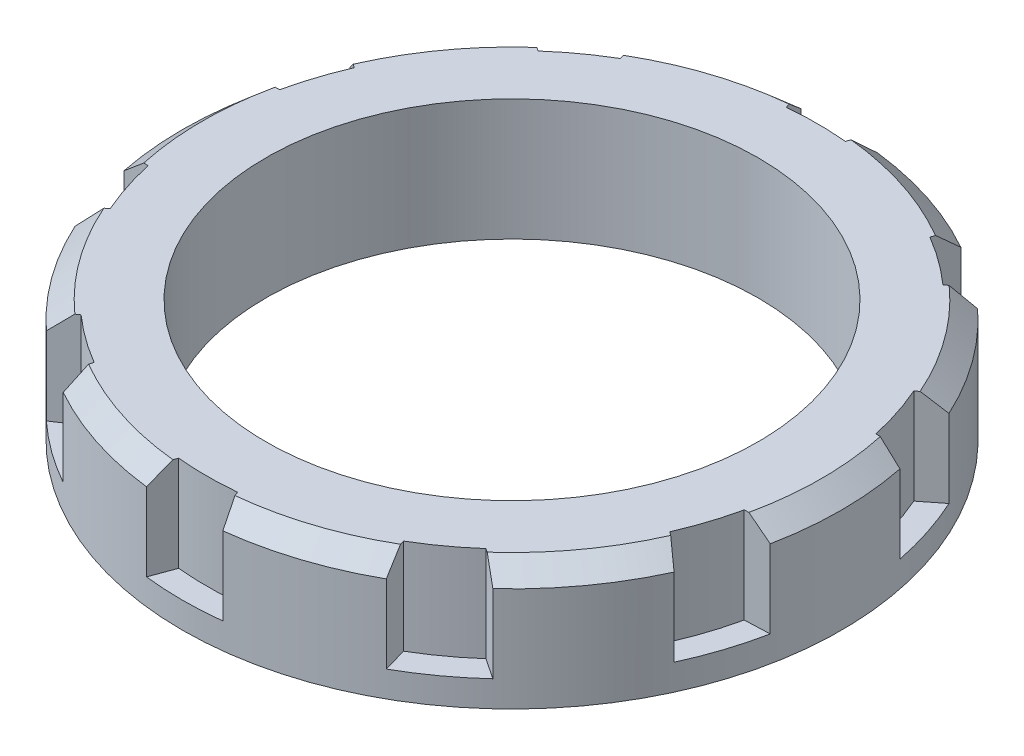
from build123d import *

# Parameters (mm, degrees)
CUT_EXTRUDE_START   = -5.5
SKETCH_2_R          = 25
CUT_EXTRUDE_1_DEPTH = 5.5


with BuildPart() as part:
    # Sketch 1 → Revolve 1 (revolve)
    with BuildSketch(Plane.XY, mode=Mode.PRIVATE) as revolve_1_sk:
        Polygon((-19, 6), (-19, 0), (-14.188, 0), (-14.188, 7), (-17.85, 7), align=None)
    revolve(revolve_1_sk.sketch.rotate(Axis((0, 7, 0), (0, -1, 0)), 90), axis=Axis((0, 7, 0), (0, -1, 0)))

    # Sketch 2 → Cut-Extrude 1 (cut)
    with BuildSketch(Plane(origin=(0, 7, 0), x_dir=(1, 0, 0), z_dir=(0, 1, 0)).offset(CUT_EXTRUDE_START)):
        Circle(SKETCH_2_R)
        with BuildLine():
            Line((-18.628367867, -3.739506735), (-17.185656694, -3.796472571))
            ThreePointArc((-17.185656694, -3.796472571), (-16.738594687, -5.438699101), (-16.134998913, -7.030064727))
            Line((-16.134998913, -7.030064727), (-17.268693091, -7.924155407))
            ThreePointArc((-17.268693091, -7.924155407), (-15.371322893, -11.167919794), (-12.872639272, -13.974804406))
            Line((-12.872639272, -13.974804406), (-11.671977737, -13.172886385))
            ThreePointArc((-11.671977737, -13.172886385), (-10.34502044, -14.238699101), (-8.921319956, -15.171356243))
            Line((-8.921319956, -15.171356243), (-9.312964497, -16.561059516))
            ThreePointArc((-9.312964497, -16.561059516), (-5.871322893, -18.07007381), (-2.2, -18.872201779))
            Line((-2.2, -18.872201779), (-1.7, -17.517705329))
            ThreePointArc((-1.7, -17.517705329), (0, -17.6), (1.7, -17.517705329))
            Line((1.7, -17.517705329), (2.2, -18.872201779))
            ThreePointArc((2.2, -18.872201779), (5.871322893, -18.07007381), (9.312964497, -16.561059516))
            Line((9.312964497, -16.561059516), (8.921319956, -15.171356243))
            ThreePointArc((8.921319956, -15.171356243), (10.34502044, -14.238699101), (11.671977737, -13.172886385))
            Line((11.671977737, -13.172886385), (12.872639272, -13.974804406))
            ThreePointArc((12.872639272, -13.974804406), (15.371322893, -11.167919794), (17.268693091, -7.924155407))
            Line((17.268693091, -7.924155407), (16.134998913, -7.030064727))
            ThreePointArc((16.134998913, -7.030064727), (16.738594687, -5.438699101), (17.185656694, -3.796472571))
            Line((17.185656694, -3.796472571), (18.628367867, -3.739506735))
            ThreePointArc((18.628367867, -3.739506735), (19, 0), (18.628367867, 3.739506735))
            Line((18.628367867, 3.739506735), (17.185656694, 3.796472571))
            ThreePointArc((17.185656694, 3.796472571), (16.738594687, 5.438699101), (16.134998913, 7.030064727))
            Line((16.134998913, 7.030064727), (17.268693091, 7.924155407))
            ThreePointArc((17.268693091, 7.924155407), (15.371322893, 11.167919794), (12.872639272, 13.974804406))
            Line((12.872639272, 13.974804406), (11.671977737, 13.172886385))
            ThreePointArc((11.671977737, 13.172886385), (10.34502044, 14.238699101), (8.921319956, 15.171356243))
            Line((8.921319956, 15.171356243), (9.312964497, 16.561059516))
            ThreePointArc((9.312964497, 16.561059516), (5.871322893, 18.07007381), (2.2, 18.872201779))
            Line((2.2, 18.872201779), (1.7, 17.517705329))
            ThreePointArc((1.7, 17.517705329), (0, 17.6), (-1.7, 17.517705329))
            Line((-1.7, 17.517705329), (-2.2, 18.872201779))
            ThreePointArc((-2.2, 18.872201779), (-5.871322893, 18.07007381), (-9.312964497, 16.561059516))
            Line((-9.312964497, 16.561059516), (-8.921319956, 15.171356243))
            ThreePointArc((-8.921319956, 15.171356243), (-10.34502044, 14.238699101), (-11.671977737, 13.172886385))
            Line((-11.671977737, 13.172886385), (-12.872639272, 13.974804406))
            ThreePointArc((-12.872639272, 13.974804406), (-15.371322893, 11.167919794), (-17.268693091, 7.924155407))
            Line((-17.268693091, 7.924155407), (-16.134998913, 7.030064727))
            ThreePointArc((-16.134998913, 7.030064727), (-16.738594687, 5.438699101), (-17.185656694, 3.796472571))
            Line((-17.185656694, 3.796472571), (-18.628367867, 3.739506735))
            ThreePointArc((-18.628367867, 3.739506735), (-19, 0), (-18.628367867, -3.739506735))
        make_face(mode=Mode.SUBTRACT)
    extrude(amount=CUT_EXTRUDE_1_DEPTH, mode=Mode.SUBTRACT)


solid = part.part
